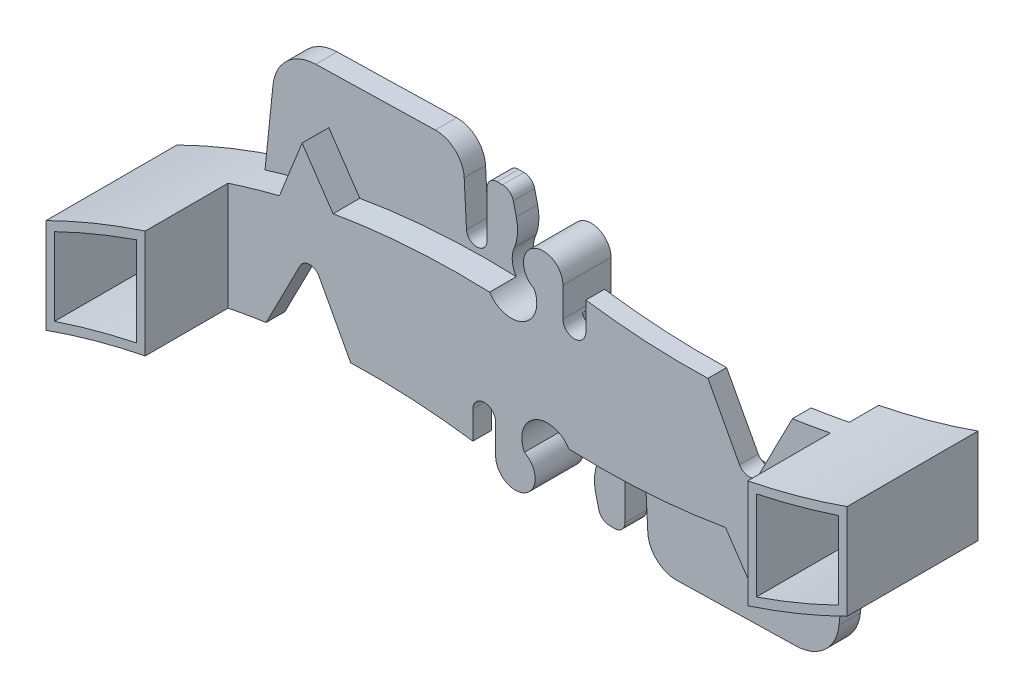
from build123d import *

# Parameters (mm, degrees)
EXTRUDE_1_DEPTH          = 22.5
CUT_EXTRUDE_1_DEPTH      = 22.5
CUT_EXTRUDE_1_DEPTH_BACK = 2.5
CUT_EXTRUDE_2_DEPTH      = 5
CUT_EXTRUDE_2_DEPTH_BACK = 25
EXTRUDE_START            = 100
EXTRUDE_2_DEPTH          = 100
CUT_EXTRUDE_3_DEPTH      = 415.146246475
CUT_EXTRUDE_3_DEPTH_BACK = 120
SCALE_1_SCALE            = 0.1


with BuildPart() as part:
    # Sketch 2 → Extrude 1 (new, symmetric)
    with BuildSketch(Plane.XY):
        with BuildLine():
            Line((-374.894771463, -27.080967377), (-374.894771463, -116.004191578))
            ThreePointArc((-374.894771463, -116.004191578), (-311.371872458, -96.969256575), (-246.300467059, -84.194294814))
            Line((-246.300467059, -84.194294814), (-214.458020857, -22.111585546))
            ThreePointArc((-214.458020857, -22.111585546), (-205.611129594, -16.815967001), (-196.764238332, -22.111585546))
            Line((-196.764238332, -22.111585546), (-167.183998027, -77.297540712))
            ThreePointArc((-167.183998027, -77.297540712), (-109.866007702, -78.06296645), (-52.814814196, -83.639633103))
            Line((-52.814814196, -83.639633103), (-52.814814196, -57.528729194))
            ThreePointArc((-52.814814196, -57.528729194), (-42.157407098, -46.871322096), (-31.5, -57.528729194))
            Line((-31.5, -57.528729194), (-31.5, -85))
            ThreePointArc((-31.5, -85), (-3.351583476, -100.784741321), (-4.563993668, -68.535377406))
            ThreePointArc((-4.563993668, -68.535377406), (16.701178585, -34.001860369), (38.819637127, -67.995170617))
            ThreePointArc((38.819637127, -67.995170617), (36.09167694, -80.562316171), (37.178013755, -93.376167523))
            Line((37.178013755, -93.376167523), (39.976096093, -105.128204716))
            ThreePointArc((39.976096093, -105.128204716), (43.634318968, -110.860679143), (50.05822132, -113.091673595))
            Line((50.05822132, -113.091673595), (54.985912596, -113.091673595))
            ThreePointArc((54.985912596, -113.091673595), (61.738843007, -110.294518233), (64.535998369, -103.541587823))
            Line((64.535998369, -103.541587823), (64.535998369, -60.319969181))
            ThreePointArc((64.535998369, -60.319969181), (73.93145845, -50.678229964), (83.813023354, -59.821122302))
            Line((83.813023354, -59.821122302), (85.939015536, -100.871153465))
            ThreePointArc((85.939015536, -100.871153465), (94.397114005, -118.958956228), (113.070185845, -126.031751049))
            Line((113.070185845, -126.031751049), (224.926083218, -123.392727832))
            ThreePointArc((224.926083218, -123.392727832), (251.916905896, -112.461283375), (264.936918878, -86.413629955))
            Line((264.936918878, -86.413629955), (272.371064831, -14.000647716))
            ThreePointArc((272.371064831, -14.000647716), (324.498972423, 4.508046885), (375, 27.080967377))
            Line((375, 27.080967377), (375, 116.004191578))
            ThreePointArc((375, 116.004191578), (311.421299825, 96.955455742), (246.291939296, 84.177668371))
            Line((246.291939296, 84.177668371), (214.458020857, 22.111585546))
            ThreePointArc((214.458020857, 22.111585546), (205.611129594, 16.815967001), (196.764238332, 22.111585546))
            Line((196.764238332, 22.111585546), (167.185587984, 77.29457443))
            ThreePointArc((167.185587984, 77.29457443), (109.919475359, 78.06583871), (52.920042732, 83.639633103))
            Line((52.920042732, 83.639633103), (52.920042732, 57.528729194))
            ThreePointArc((52.920042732, 57.528729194), (42.210021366, 46.818707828), (31.5, 57.528729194))
            Line((31.5, 57.528729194), (31.5, 85))
            ThreePointArc((31.5, 85), (3.351583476, 100.784741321), (4.563993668, 68.535377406))
            ThreePointArc((4.563993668, 68.535377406), (-16.827430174, 34.000620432), (-38.713267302, 68.224188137))
            ThreePointArc((-38.713267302, 68.224188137), (-36.079008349, 80.686240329), (-37.178013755, 93.376167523))
            Line((-37.178013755, 93.376167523), (-39.976096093, 105.128204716))
            ThreePointArc((-39.976096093, 105.128204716), (-43.634318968, 110.860679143), (-50.05822132, 113.091673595))
            Line((-50.05822132, 113.091673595), (-54.985912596, 113.091673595))
            ThreePointArc((-54.985912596, 113.091673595), (-61.738843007, 110.294518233), (-64.535998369, 103.541587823))
            Line((-64.535998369, 103.541587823), (-64.535998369, 60.319969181))
            ThreePointArc((-64.535998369, 60.319969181), (-73.93145845, 50.678229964), (-83.813023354, 59.821122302))
            Line((-83.813023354, 59.821122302), (-85.939015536, 100.871153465))
            ThreePointArc((-85.939015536, 100.871153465), (-94.397114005, 118.958956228), (-113.070185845, 126.031751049))
            Line((-113.070185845, 126.031751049), (-224.926083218, 123.392727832))
            ThreePointArc((-224.926083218, 123.392727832), (-251.916905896, 112.461283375), (-264.936918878, 86.413629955))
            Line((-264.936918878, 86.413629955), (-272.374537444, 13.966822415))
            ThreePointArc((-272.374537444, 13.966822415), (-324.446587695, -4.529202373), (-374.894771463, -27.080967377))
        make_face()
    extrude(amount=EXTRUDE_1_DEPTH, both=True)

    # Sketch 3 → Cut-Extrude 1 (cut, two sides: drawn at the far end of the back side and taken through both)
    with BuildSketch(Plane.XY.offset(-CUT_EXTRUDE_1_DEPTH_BACK)):
        with BuildLine():
            Line((212.683768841, -78.109207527), (233.907889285, -24.770851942))
            ThreePointArc((233.907889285, -24.770851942), (305.851894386, -2.648852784), (375, 27.080967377))
            Line((375, 27.080967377), (375, -189.558483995))
            Line((375, -189.558483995), (28.89882292, -189.558483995))
            Line((28.89882292, -189.558483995), (28.89882292, -44.629885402))
            ThreePointArc((28.89882292, -44.629885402), (106.531127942, -44.299647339), (183.647965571, -35.362243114))
            Line((183.647965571, -35.362243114), (212.683768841, -78.109207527))
        make_face()
        with BuildLine():
            Line((-212.683768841, 78.109207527), (-183.636917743, 35.345978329))
            ThreePointArc((-183.636917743, 35.345978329), (-103.282877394, 44.480774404), (-22.411540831, 44.272874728))
            Line((-22.411540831, 44.272874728), (-22.411540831, 190.382553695))
            Line((-22.411540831, 190.382553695), (-374.894771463, 190.382553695))
            Line((-374.894771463, 190.382553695), (-374.894771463, -27.080967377))
            ThreePointArc((-374.894771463, -27.080967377), (-305.803174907, 2.628082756), (-233.91948909, 24.741700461))
            Line((-233.91948909, 24.741700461), (-212.683768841, 78.109207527))
        make_face()
    extrude(amount=CUT_EXTRUDE_1_DEPTH + CUT_EXTRUDE_1_DEPTH_BACK, mode=Mode.SUBTRACT)

    # Sketch 4 → Cut-Extrude 2 (cut, two sides: drawn at the far end of the back side and taken through both)
    with BuildSketch(Plane.XY.offset(-CUT_EXTRUDE_2_DEPTH_BACK)):
        with BuildLine():
            Line((32, 191.573042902), (32, 22.103044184))
            ThreePointArc((32, 22.103044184), (38.874266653, 4.88509452), (55.716623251, -2.863992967))
            Line((55.716623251, -2.863992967), (234.689921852, -12.063729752))
            ThreePointArc((234.689921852, -12.063729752), (267.992309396, 0.250617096), (282, 32.87693712))
            Line((282, 32.87693712), (282, 90.36683841))
            Line((282, 90.36683841), (32, 191.573042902))
        make_face()
        with BuildLine():
            Line((-282, -32.87693712), (-282, -90.36683841))
            Line((-282, -90.36683841), (-32, -226.810492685))
            Line((-32, -226.810492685), (-32, -22.103044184))
            ThreePointArc((-32, -22.103044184), (-38.874266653, -4.88509452), (-55.716623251, 2.863992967))
            Line((-55.716623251, 2.863992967), (-234.689921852, 12.063729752))
            ThreePointArc((-234.689921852, 12.063729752), (-267.992309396, -0.250617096), (-282, -32.87693712))
        make_face()
    extrude(amount=CUT_EXTRUDE_2_DEPTH + CUT_EXTRUDE_2_DEPTH_BACK, mode=Mode.SUBTRACT)

    # Sketch 5 → Extrude 2 (add)
    with BuildSketch(Plane.XY.offset(EXTRUDE_START)):
        with BuildLine():
            Line((-282, 10.894254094), (-282, -90.387980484))
            ThreePointArc((-282, -90.387980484), (-328.900427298, -101.553173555), (-374.894771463, -116.004191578))
            Line((-374.894771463, -116.004191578), (-374.894771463, -27.080967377))
            ThreePointArc((-374.894771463, -27.080967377), (-329.129825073, -6.423977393), (-282, 10.894254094))
        make_face()
        with BuildLine():
            Line((375, 27.080967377), (375, 116.004191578))
            ThreePointArc((375, 116.004191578), (328.953920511, 101.538909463), (282, 90.36683841))
            Line((282, 90.36683841), (282, -10.928675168))
            ThreePointArc((282, -10.928675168), (329.183811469, 6.403032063), (375, 27.080967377))
        make_face()
    extrude(amount=-EXTRUDE_2_DEPTH)

    # Sketch 6 → Cut-Extrude 3 (cut, two sides: drawn at the far end of the back side and taken through both)
    with BuildSketch(Plane.XY.offset(100).offset(-CUT_EXTRUDE_3_DEPTH_BACK)):
        with BuildLine():
            Line((-366.894771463, -32.065706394), (-366.894771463, -104.788964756))
            ThreePointArc((-366.894771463, -104.788964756), (-328.749702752, -93.217210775), (-290, -83.86775657))
            Line((-290, -83.86775657), (-290, -0.233856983))
            ThreePointArc((-290, -0.233856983), (-328.927068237, -14.991034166), (-366.894771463, -32.065706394))
        make_face()
        with BuildLine():
            Line((367, 32.065706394), (367, 104.788964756))
            ThreePointArc((367, 104.788964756), (328.803046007, 93.203096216), (290, 83.845571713))
            Line((290, 83.845571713), (290, 0.197560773))
            ThreePointArc((290, 0.197560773), (328.98087178, 14.969748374), (367, 32.065706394))
        make_face()
    extrude(amount=CUT_EXTRUDE_3_DEPTH + CUT_EXTRUDE_3_DEPTH_BACK, mode=Mode.SUBTRACT)


with BuildPart() as part_1:
    # Scale 1: scaled about (0, 0, 0)
    add(part.part.scale(SCALE_1_SCALE))


solid = part_1.part
